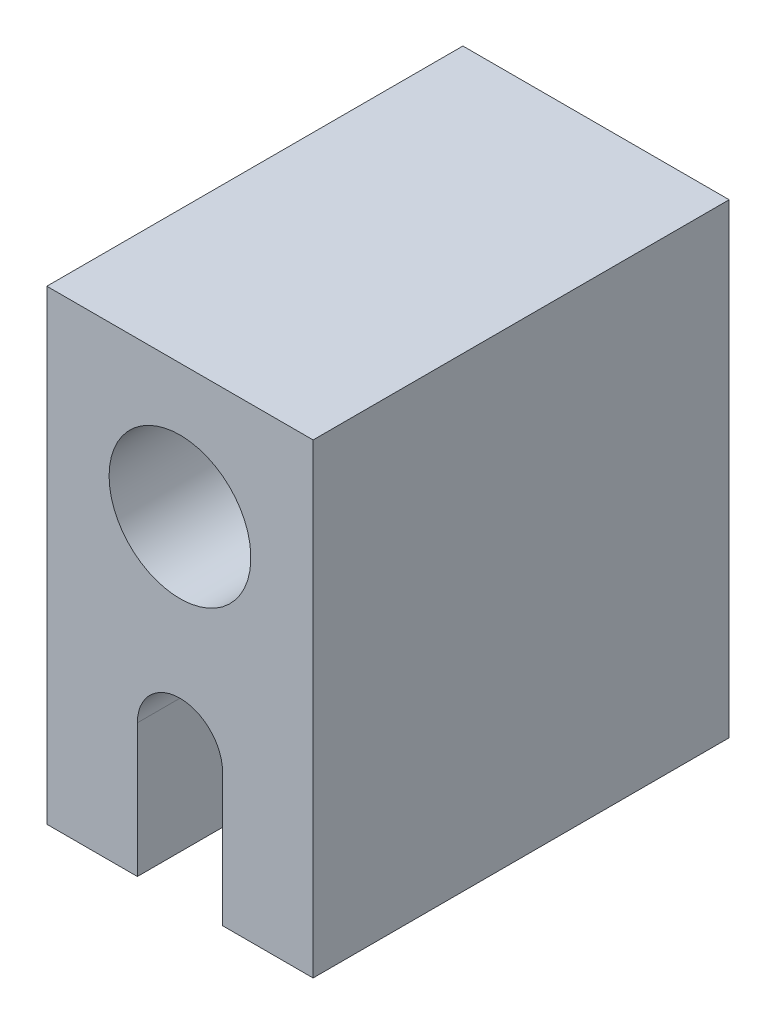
ISO-10303-21;
HEADER;
FILE_DESCRIPTION(('STEP AP214'),'2;1');
FILE_NAME('part.step','',(''),(''),'','','');
FILE_SCHEMA(('AUTOMOTIVE_DESIGN { 1 0 10303 214 1 1 1 1 }'));
ENDSEC;
DATA;
#1=APPLICATION_CONTEXT('core data for automotive mechanical design processes');
#2=APPLICATION_PROTOCOL_DEFINITION('international standard','automotive_design',2000,#1);
#3=PRODUCT_CONTEXT('',#1,'mechanical');
#4=PRODUCT('Part','Part','',(#3));
#5=PRODUCT_RELATED_PRODUCT_CATEGORY('part','',(#4));
#6=PRODUCT_DEFINITION_FORMATION('','',#4);
#7=PRODUCT_DEFINITION_CONTEXT('part definition',#1,'design');
#8=PRODUCT_DEFINITION('design','',#6,#7);
#9=PRODUCT_DEFINITION_SHAPE('','',#8);
#10=(LENGTH_UNIT() NAMED_UNIT(*) SI_UNIT(.MILLI.,.METRE.));
#11=(NAMED_UNIT(*) PLANE_ANGLE_UNIT() SI_UNIT($,.RADIAN.));
#12=(NAMED_UNIT(*) SI_UNIT($,.STERADIAN.) SOLID_ANGLE_UNIT());
#13=UNCERTAINTY_MEASURE_WITH_UNIT(LENGTH_MEASURE(1.E-05),#10,'distance_accuracy_value','');
#14=(GEOMETRIC_REPRESENTATION_CONTEXT(3) GLOBAL_UNCERTAINTY_ASSIGNED_CONTEXT((#13)) GLOBAL_UNIT_ASSIGNED_CONTEXT((#10,
#11,#12)) REPRESENTATION_CONTEXT('',''));
#15=CARTESIAN_POINT('',(0.,0.,0.));
#16=DIRECTION('',(0.,0.,1.));
#17=DIRECTION('',(1.,0.,0.));
#18=AXIS2_PLACEMENT_3D('',#15,#16,#17);
#19=CARTESIAN_POINT('',(-2.54,0.,7.9375));
#20=DIRECTION('',(1.,0.,0.));
#21=DIRECTION('',(0.,0.,-1.));
#22=AXIS2_PLACEMENT_3D('',#19,#20,#21);
#23=PLANE('',#22);
#24=DIRECTION('',(0.,-1.,0.));
#25=VECTOR('',#24,1.);
#26=CARTESIAN_POINT('',(-2.54,0.,0.));
#27=LINE('',#26,#25);
#28=CARTESIAN_POINT('',(-2.54,8.89,0.));
#29=VERTEX_POINT('',#28);
#30=CARTESIAN_POINT('',(-2.54,0.,0.));
#31=VERTEX_POINT('',#30);
#32=EDGE_CURVE('E109',#29,#31,#27,.T.);
#33=ORIENTED_EDGE('',*,*,#32,.T.);
#34=DIRECTION('',(0.,0.,-1.));
#35=VECTOR('',#34,1.);
#36=CARTESIAN_POINT('',(-2.54,0.,7.9375));
#37=LINE('',#36,#35);
#38=CARTESIAN_POINT('',(-2.54,0.,7.9375));
#39=VERTEX_POINT('',#38);
#40=EDGE_CURVE('E13',#39,#31,#37,.T.);
#41=ORIENTED_EDGE('',*,*,#40,.F.);
#42=DIRECTION('',(0.,-1.,0.));
#43=VECTOR('',#42,1.);
#44=CARTESIAN_POINT('',(-2.54,0.,7.9375));
#45=LINE('',#44,#43);
#46=CARTESIAN_POINT('',(-2.54,8.89,7.9375));
#47=VERTEX_POINT('',#46);
#48=EDGE_CURVE('E141',#47,#39,#45,.T.);
#49=ORIENTED_EDGE('',*,*,#48,.F.);
#50=DIRECTION('',(0.,0.,-1.));
#51=VECTOR('',#50,1.);
#52=CARTESIAN_POINT('',(-2.54,8.89,7.9375));
#53=LINE('',#52,#51);
#54=EDGE_CURVE('E122',#47,#29,#53,.T.);
#55=ORIENTED_EDGE('',*,*,#54,.T.);
#56=EDGE_LOOP('',(#33,#41,#49,#55));
#57=FACE_BOUND('',#56,.T.);
#58=ADVANCED_FACE('F41',(#57),#23,.F.);
#59=CARTESIAN_POINT('',(-2.54,0.,7.9375));
#60=DIRECTION('',(0.,1.,0.));
#61=DIRECTION('',(0.,0.,1.));
#62=AXIS2_PLACEMENT_3D('',#59,#60,#61);
#63=PLANE('',#62);
#64=DIRECTION('',(1.,0.,0.));
#65=VECTOR('',#64,1.);
#66=CARTESIAN_POINT('',(-2.54,0.,0.));
#67=LINE('',#66,#65);
#68=CARTESIAN_POINT('',(-0.8128,0.,0.));
#69=VERTEX_POINT('',#68);
#70=EDGE_CURVE('E105',#31,#69,#67,.T.);
#71=ORIENTED_EDGE('',*,*,#70,.T.);
#72=DIRECTION('',(0.,0.,-1.));
#73=VECTOR('',#72,1.);
#74=CARTESIAN_POINT('',(-0.8128,0.,7.9375));
#75=LINE('',#74,#73);
#76=CARTESIAN_POINT('',(-0.8128,0.,7.9375));
#77=VERTEX_POINT('',#76);
#78=EDGE_CURVE('E48',#77,#69,#75,.T.);
#79=ORIENTED_EDGE('',*,*,#78,.F.);
#80=DIRECTION('',(1.,0.,0.));
#81=VECTOR('',#80,1.);
#82=CARTESIAN_POINT('',(-2.54,0.,7.9375));
#83=LINE('',#82,#81);
#84=EDGE_CURVE('E118',#39,#77,#83,.T.);
#85=ORIENTED_EDGE('',*,*,#84,.F.);
#86=ORIENTED_EDGE('',*,*,#40,.T.);
#87=EDGE_LOOP('',(#71,#79,#85,#86));
#88=FACE_BOUND('',#87,.T.);
#89=ADVANCED_FACE('F117',(#88),#63,.F.);
#90=CARTESIAN_POINT('',(-0.8128,0.,7.9375));
#91=DIRECTION('',(-1.,0.,0.));
#92=DIRECTION('',(0.,0.,1.));
#93=AXIS2_PLACEMENT_3D('',#90,#91,#92);
#94=PLANE('',#93);
#95=DIRECTION('',(0.,1.,0.));
#96=VECTOR('',#95,1.);
#97=CARTESIAN_POINT('',(-0.8128,0.,0.));
#98=LINE('',#97,#96);
#99=CARTESIAN_POINT('',(-0.8128,2.54,0.));
#100=VERTEX_POINT('',#99);
#101=EDGE_CURVE('E111',#69,#100,#98,.T.);
#102=ORIENTED_EDGE('',*,*,#101,.T.);
#103=DIRECTION('',(0.,0.,-1.));
#104=VECTOR('',#103,1.);
#105=CARTESIAN_POINT('',(-0.8128,2.54,7.9375));
#106=LINE('',#105,#104);
#107=CARTESIAN_POINT('',(-0.8128,2.54,7.9375));
#108=VERTEX_POINT('',#107);
#109=EDGE_CURVE('E167',#108,#100,#106,.T.);
#110=ORIENTED_EDGE('',*,*,#109,.F.);
#111=DIRECTION('',(0.,1.,0.));
#112=VECTOR('',#111,1.);
#113=CARTESIAN_POINT('',(-0.8128,0.,7.9375));
#114=LINE('',#113,#112);
#115=EDGE_CURVE('E144',#77,#108,#114,.T.);
#116=ORIENTED_EDGE('',*,*,#115,.F.);
#117=ORIENTED_EDGE('',*,*,#78,.T.);
#118=EDGE_LOOP('',(#102,#110,#116,#117));
#119=FACE_BOUND('',#118,.T.);
#120=ADVANCED_FACE('F171',(#119),#94,.F.);
#121=CARTESIAN_POINT('',(0.,2.54,7.9375));
#122=DIRECTION('',(0.,0.,-1.));
#123=DIRECTION('',(-1.,0.,0.));
#124=AXIS2_PLACEMENT_3D('',#121,#122,#123);
#125=CYLINDRICAL_SURFACE('',#124,0.8128);
#126=CARTESIAN_POINT('',(0.,2.54,0.));
#127=DIRECTION('',(0.,0.,-1.));
#128=DIRECTION('',(-1.,0.,0.));
#129=AXIS2_PLACEMENT_3D('',#126,#127,#128);
#130=CIRCLE('',#129,0.8128);
#131=CARTESIAN_POINT('',(0.8128,2.54,0.));
#132=VERTEX_POINT('',#131);
#133=EDGE_CURVE('E131',#100,#132,#130,.T.);
#134=ORIENTED_EDGE('',*,*,#133,.T.);
#135=DIRECTION('',(0.,0.,-1.));
#136=VECTOR('',#135,1.);
#137=CARTESIAN_POINT('',(0.8128,2.54,7.9375));
#138=LINE('',#137,#136);
#139=CARTESIAN_POINT('',(0.8128,2.54,7.9375));
#140=VERTEX_POINT('',#139);
#141=EDGE_CURVE('E164',#140,#132,#138,.T.);
#142=ORIENTED_EDGE('',*,*,#141,.F.);
#143=CARTESIAN_POINT('',(0.,2.54,7.9375));
#144=DIRECTION('',(0.,0.,-1.));
#145=DIRECTION('',(-1.,0.,0.));
#146=AXIS2_PLACEMENT_3D('',#143,#144,#145);
#147=CIRCLE('',#146,0.8128);
#148=EDGE_CURVE('E146',#108,#140,#147,.T.);
#149=ORIENTED_EDGE('',*,*,#148,.F.);
#150=ORIENTED_EDGE('',*,*,#109,.T.);
#151=EDGE_LOOP('',(#134,#142,#149,#150));
#152=FACE_BOUND('',#151,.T.);
#153=ADVANCED_FACE('F179',(#152),#125,.F.);
#154=CARTESIAN_POINT('',(0.8128,2.54,7.9375));
#155=DIRECTION('',(1.,0.,0.));
#156=DIRECTION('',(0.,1.,0.));
#157=AXIS2_PLACEMENT_3D('',#154,#155,#156);
#158=PLANE('',#157);
#159=DIRECTION('',(0.,-1.,0.));
#160=VECTOR('',#159,1.);
#161=CARTESIAN_POINT('',(0.8128,2.54,0.));
#162=LINE('',#161,#160);
#163=CARTESIAN_POINT('',(0.8128,0.,0.));
#164=VERTEX_POINT('',#163);
#165=EDGE_CURVE('E133',#132,#164,#162,.T.);
#166=ORIENTED_EDGE('',*,*,#165,.T.);
#167=DIRECTION('',(0.,0.,-1.));
#168=VECTOR('',#167,1.);
#169=CARTESIAN_POINT('',(0.8128,0.,7.9375));
#170=LINE('',#169,#168);
#171=CARTESIAN_POINT('',(0.8128,0.,7.9375));
#172=VERTEX_POINT('',#171);
#173=EDGE_CURVE('E161',#172,#164,#170,.T.);
#174=ORIENTED_EDGE('',*,*,#173,.F.);
#175=DIRECTION('',(0.,-1.,0.));
#176=VECTOR('',#175,1.);
#177=CARTESIAN_POINT('',(0.8128,2.54,7.9375));
#178=LINE('',#177,#176);
#179=EDGE_CURVE('E148',#140,#172,#178,.T.);
#180=ORIENTED_EDGE('',*,*,#179,.F.);
#181=ORIENTED_EDGE('',*,*,#141,.T.);
#182=EDGE_LOOP('',(#166,#174,#180,#181));
#183=FACE_BOUND('',#182,.T.);
#184=ADVANCED_FACE('F182',(#183),#158,.F.);
#185=CARTESIAN_POINT('',(0.8128,0.,7.9375));
#186=DIRECTION('',(0.,1.,0.));
#187=DIRECTION('',(-1.,0.,0.));
#188=AXIS2_PLACEMENT_3D('',#185,#186,#187);
#189=PLANE('',#188);
#190=DIRECTION('',(1.,0.,0.));
#191=VECTOR('',#190,1.);
#192=CARTESIAN_POINT('',(0.8128,0.,0.));
#193=LINE('',#192,#191);
#194=CARTESIAN_POINT('',(2.54,0.,0.));
#195=VERTEX_POINT('',#194);
#196=EDGE_CURVE('E135',#164,#195,#193,.T.);
#197=ORIENTED_EDGE('',*,*,#196,.T.);
#198=DIRECTION('',(0.,0.,-1.));
#199=VECTOR('',#198,1.);
#200=CARTESIAN_POINT('',(2.54,0.,7.9375));
#201=LINE('',#200,#199);
#202=CARTESIAN_POINT('',(2.54,0.,7.9375));
#203=VERTEX_POINT('',#202);
#204=EDGE_CURVE('E158',#203,#195,#201,.T.);
#205=ORIENTED_EDGE('',*,*,#204,.F.);
#206=DIRECTION('',(1.,0.,0.));
#207=VECTOR('',#206,1.);
#208=CARTESIAN_POINT('',(0.8128,0.,7.9375));
#209=LINE('',#208,#207);
#210=EDGE_CURVE('E150',#172,#203,#209,.T.);
#211=ORIENTED_EDGE('',*,*,#210,.F.);
#212=ORIENTED_EDGE('',*,*,#173,.T.);
#213=EDGE_LOOP('',(#197,#205,#211,#212));
#214=FACE_BOUND('',#213,.T.);
#215=ADVANCED_FACE('F187',(#214),#189,.F.);
#216=CARTESIAN_POINT('',(2.54,0.,7.9375));
#217=DIRECTION('',(-1.,0.,0.));
#218=DIRECTION('',(0.,0.,1.));
#219=AXIS2_PLACEMENT_3D('',#216,#217,#218);
#220=PLANE('',#219);
#221=DIRECTION('',(0.,1.,0.));
#222=VECTOR('',#221,1.);
#223=CARTESIAN_POINT('',(2.54,0.,0.));
#224=LINE('',#223,#222);
#225=CARTESIAN_POINT('',(2.54,8.89,0.));
#226=VERTEX_POINT('',#225);
#227=EDGE_CURVE('E137',#195,#226,#224,.T.);
#228=ORIENTED_EDGE('',*,*,#227,.T.);
#229=DIRECTION('',(0.,0.,-1.));
#230=VECTOR('',#229,1.);
#231=CARTESIAN_POINT('',(2.54,8.89,7.9375));
#232=LINE('',#231,#230);
#233=CARTESIAN_POINT('',(2.54,8.89,7.9375));
#234=VERTEX_POINT('',#233);
#235=EDGE_CURVE('E155',#234,#226,#232,.T.);
#236=ORIENTED_EDGE('',*,*,#235,.F.);
#237=DIRECTION('',(0.,1.,0.));
#238=VECTOR('',#237,1.);
#239=CARTESIAN_POINT('',(2.54,0.,7.9375));
#240=LINE('',#239,#238);
#241=EDGE_CURVE('E60',#203,#234,#240,.T.);
#242=ORIENTED_EDGE('',*,*,#241,.F.);
#243=ORIENTED_EDGE('',*,*,#204,.T.);
#244=EDGE_LOOP('',(#228,#236,#242,#243));
#245=FACE_BOUND('',#244,.T.);
#246=ADVANCED_FACE('F190',(#245),#220,.F.);
#247=CARTESIAN_POINT('',(-2.54,8.89,7.9375));
#248=DIRECTION('',(0.,-1.,0.));
#249=DIRECTION('',(0.,0.,-1.));
#250=AXIS2_PLACEMENT_3D('',#247,#248,#249);
#251=PLANE('',#250);
#252=DIRECTION('',(-1.,0.,0.));
#253=VECTOR('',#252,1.);
#254=CARTESIAN_POINT('',(-2.54,8.89,0.));
#255=LINE('',#254,#253);
#256=EDGE_CURVE('E139',#226,#29,#255,.T.);
#257=ORIENTED_EDGE('',*,*,#256,.T.);
#258=ORIENTED_EDGE('',*,*,#54,.F.);
#259=DIRECTION('',(-1.,0.,0.));
#260=VECTOR('',#259,1.);
#261=CARTESIAN_POINT('',(-2.54,8.89,7.9375));
#262=LINE('',#261,#260);
#263=EDGE_CURVE('E55',#234,#47,#262,.T.);
#264=ORIENTED_EDGE('',*,*,#263,.F.);
#265=ORIENTED_EDGE('',*,*,#235,.T.);
#266=EDGE_LOOP('',(#257,#258,#264,#265));
#267=FACE_BOUND('',#266,.T.);
#268=ADVANCED_FACE('F192',(#267),#251,.F.);
#269=CARTESIAN_POINT('',(0.,2.54,7.9375));
#270=DIRECTION('',(0.,0.,-1.));
#271=DIRECTION('',(-1.,0.,0.));
#272=AXIS2_PLACEMENT_3D('',#269,#270,#271);
#273=PLANE('',#272);
#274=CARTESIAN_POINT('',(0.,6.35,7.9375));
#275=DIRECTION('',(0.,0.,-1.));
#276=DIRECTION('',(-1.,0.,0.));
#277=AXIS2_PLACEMENT_3D('',#274,#275,#276);
#278=CIRCLE('',#277,1.35255);
#279=CARTESIAN_POINT('',(-1.35255,6.35,7.9375));
#280=VERTEX_POINT('',#279);
#281=EDGE_CURVE('E126',#280,#280,#278,.T.);
#282=ORIENTED_EDGE('',*,*,#281,.T.);
#283=EDGE_LOOP('',(#282));
#284=FACE_BOUND('',#283,.T.);
#285=ORIENTED_EDGE('',*,*,#48,.T.);
#286=ORIENTED_EDGE('',*,*,#84,.T.);
#287=ORIENTED_EDGE('',*,*,#115,.T.);
#288=ORIENTED_EDGE('',*,*,#148,.T.);
#289=ORIENTED_EDGE('',*,*,#179,.T.);
#290=ORIENTED_EDGE('',*,*,#210,.T.);
#291=ORIENTED_EDGE('',*,*,#241,.T.);
#292=ORIENTED_EDGE('',*,*,#263,.T.);
#293=EDGE_LOOP('',(#285,#286,#287,#288,#289,#290,#291,#292));
#294=FACE_BOUND('',#293,.T.);
#295=ADVANCED_FACE('F174',(#284,#294),#273,.F.);
#296=CARTESIAN_POINT('',(0.,2.54,0.));
#297=DIRECTION('',(0.,0.,-1.));
#298=DIRECTION('',(-1.,0.,0.));
#299=AXIS2_PLACEMENT_3D('',#296,#297,#298);
#300=PLANE('',#299);
#301=CARTESIAN_POINT('',(0.,6.35,0.));
#302=DIRECTION('',(0.,0.,-1.));
#303=DIRECTION('',(-1.,0.,0.));
#304=AXIS2_PLACEMENT_3D('',#301,#302,#303);
#305=CIRCLE('',#304,1.35254999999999);
#306=CARTESIAN_POINT('',(-1.35254999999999,6.35,0.));
#307=VERTEX_POINT('',#306);
#308=EDGE_CURVE('E123',#307,#307,#305,.T.);
#309=ORIENTED_EDGE('',*,*,#308,.F.);
#310=EDGE_LOOP('',(#309));
#311=FACE_BOUND('',#310,.T.);
#312=ORIENTED_EDGE('',*,*,#32,.F.);
#313=ORIENTED_EDGE('',*,*,#256,.F.);
#314=ORIENTED_EDGE('',*,*,#227,.F.);
#315=ORIENTED_EDGE('',*,*,#196,.F.);
#316=ORIENTED_EDGE('',*,*,#165,.F.);
#317=ORIENTED_EDGE('',*,*,#133,.F.);
#318=ORIENTED_EDGE('',*,*,#101,.F.);
#319=ORIENTED_EDGE('',*,*,#70,.F.);
#320=EDGE_LOOP('',(#312,#313,#314,#315,#316,#317,#318,#319));
#321=FACE_BOUND('',#320,.T.);
#322=ADVANCED_FACE('F106',(#311,#321),#300,.T.);
#323=CARTESIAN_POINT('',(0.,6.35,0.));
#324=DIRECTION('',(0.,0.,-1.));
#325=DIRECTION('',(-1.,0.,0.));
#326=AXIS2_PLACEMENT_3D('',#323,#324,#325);
#327=CYLINDRICAL_SURFACE('',#326,1.35254999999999);
#328=ORIENTED_EDGE('',*,*,#281,.F.);
#329=EDGE_LOOP('',(#328));
#330=FACE_BOUND('',#329,.T.);
#331=ORIENTED_EDGE('',*,*,#308,.T.);
#332=EDGE_LOOP('',(#331));
#333=FACE_BOUND('',#332,.T.);
#334=ADVANCED_FACE('F237',(#330,#333),#327,.F.);
#335=CLOSED_SHELL('',(#58,#89,#120,#153,#184,#215,#246,#268,#295,#322,#334));
#336=MANIFOLD_SOLID_BREP('B2',#335);
#337=ADVANCED_BREP_SHAPE_REPRESENTATION('',(#18,#336),#14);
#338=SHAPE_DEFINITION_REPRESENTATION(#9,#337);
ENDSEC;
END-ISO-10303-21;
